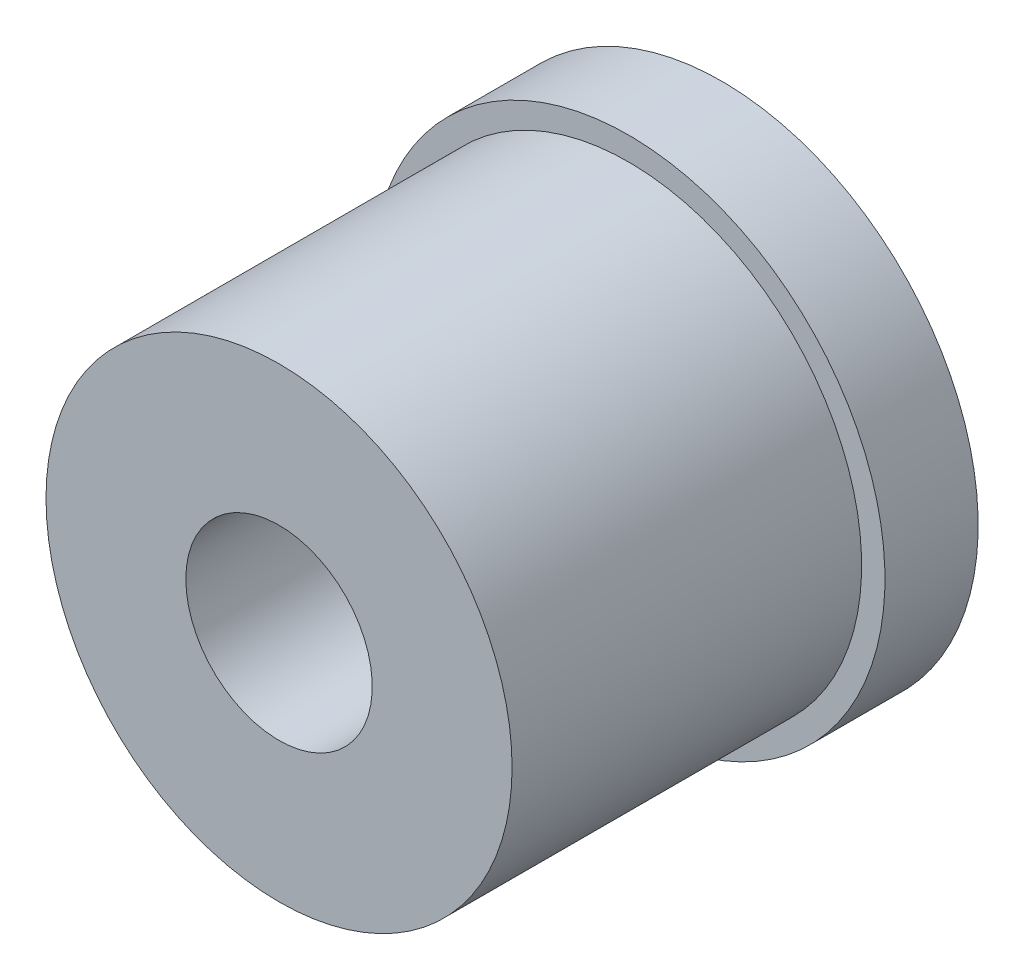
ISO-10303-21;
HEADER;
FILE_DESCRIPTION(('STEP AP214'),'2;1');
FILE_NAME('part.step','',(''),(''),'','','');
FILE_SCHEMA(('AUTOMOTIVE_DESIGN { 1 0 10303 214 1 1 1 1 }'));
ENDSEC;
DATA;
#1=APPLICATION_CONTEXT('core data for automotive mechanical design processes');
#2=APPLICATION_PROTOCOL_DEFINITION('international standard','automotive_design',2000,#1);
#3=PRODUCT_CONTEXT('',#1,'mechanical');
#4=PRODUCT('Part','Part','',(#3));
#5=PRODUCT_RELATED_PRODUCT_CATEGORY('part','',(#4));
#6=PRODUCT_DEFINITION_FORMATION('','',#4);
#7=PRODUCT_DEFINITION_CONTEXT('part definition',#1,'design');
#8=PRODUCT_DEFINITION('design','',#6,#7);
#9=PRODUCT_DEFINITION_SHAPE('','',#8);
#10=(LENGTH_UNIT() NAMED_UNIT(*) SI_UNIT(.MILLI.,.METRE.));
#11=(NAMED_UNIT(*) PLANE_ANGLE_UNIT() SI_UNIT($,.RADIAN.));
#12=(NAMED_UNIT(*) SI_UNIT($,.STERADIAN.) SOLID_ANGLE_UNIT());
#13=UNCERTAINTY_MEASURE_WITH_UNIT(LENGTH_MEASURE(1.E-05),#10,'distance_accuracy_value','');
#14=(GEOMETRIC_REPRESENTATION_CONTEXT(3) GLOBAL_UNCERTAINTY_ASSIGNED_CONTEXT((#13)) GLOBAL_UNIT_ASSIGNED_CONTEXT((#10,
#11,#12)) REPRESENTATION_CONTEXT('',''));
#15=CARTESIAN_POINT('',(0.,0.,0.));
#16=DIRECTION('',(0.,0.,1.));
#17=DIRECTION('',(1.,0.,0.));
#18=AXIS2_PLACEMENT_3D('',#15,#16,#17);
#19=CARTESIAN_POINT('',(0.,0.,3.75));
#20=DIRECTION('',(0.,0.,-1.));
#21=DIRECTION('',(-1.,0.,0.));
#22=AXIS2_PLACEMENT_3D('',#19,#20,#21);
#23=CYLINDRICAL_SURFACE('',#22,2.5);
#24=CARTESIAN_POINT('',(0.,0.,3.75));
#25=DIRECTION('',(0.,0.,1.));
#26=DIRECTION('',(1.,0.,0.));
#27=AXIS2_PLACEMENT_3D('',#24,#25,#26);
#28=CIRCLE('',#27,2.5);
#29=CARTESIAN_POINT('',(2.5,0.,3.75));
#30=VERTEX_POINT('',#29);
#31=EDGE_CURVE('E10',#30,#30,#28,.T.);
#32=ORIENTED_EDGE('',*,*,#31,.F.);
#33=EDGE_LOOP('',(#32));
#34=FACE_BOUND('',#33,.T.);
#35=CARTESIAN_POINT('',(0.,0.,0.));
#36=DIRECTION('',(0.,0.,-1.));
#37=DIRECTION('',(-1.,0.,0.));
#38=AXIS2_PLACEMENT_3D('',#35,#36,#37);
#39=CIRCLE('',#38,2.5);
#40=CARTESIAN_POINT('',(-2.5,0.,0.));
#41=VERTEX_POINT('',#40);
#42=EDGE_CURVE('E31',#41,#41,#39,.T.);
#43=ORIENTED_EDGE('',*,*,#42,.F.);
#44=EDGE_LOOP('',(#43));
#45=FACE_BOUND('',#44,.T.);
#46=ADVANCED_FACE('F25',(#34,#45),#23,.T.);
#47=CARTESIAN_POINT('',(0.,0.,3.75));
#48=DIRECTION('',(0.,0.,1.));
#49=DIRECTION('',(1.,0.,0.));
#50=AXIS2_PLACEMENT_3D('',#47,#48,#49);
#51=PLANE('',#50);
#52=CARTESIAN_POINT('',(0.,0.,3.75));
#53=DIRECTION('',(0.,0.,-1.));
#54=DIRECTION('',(-1.,0.,0.));
#55=AXIS2_PLACEMENT_3D('',#52,#53,#54);
#56=CIRCLE('',#55,1.);
#57=CARTESIAN_POINT('',(-1.,0.,3.75));
#58=VERTEX_POINT('',#57);
#59=EDGE_CURVE('E44',#58,#58,#56,.T.);
#60=ORIENTED_EDGE('',*,*,#59,.T.);
#61=EDGE_LOOP('',(#60));
#62=FACE_BOUND('',#61,.T.);
#63=ORIENTED_EDGE('',*,*,#31,.T.);
#64=EDGE_LOOP('',(#63));
#65=FACE_BOUND('',#64,.T.);
#66=ADVANCED_FACE('F67',(#62,#65),#51,.T.);
#67=CARTESIAN_POINT('',(0.,0.,0.));
#68=DIRECTION('',(0.,0.,-1.));
#69=DIRECTION('',(-1.,0.,0.));
#70=AXIS2_PLACEMENT_3D('',#67,#68,#69);
#71=PLANE('',#70);
#72=CARTESIAN_POINT('',(0.,0.,0.));
#73=DIRECTION('',(0.,0.,-1.));
#74=DIRECTION('',(-1.,0.,0.));
#75=AXIS2_PLACEMENT_3D('',#72,#73,#74);
#76=CIRCLE('',#75,2.75);
#77=CARTESIAN_POINT('',(-2.75,0.,0.));
#78=VERTEX_POINT('',#77);
#79=EDGE_CURVE('E39',#78,#78,#76,.T.);
#80=ORIENTED_EDGE('',*,*,#79,.F.);
#81=EDGE_LOOP('',(#80));
#82=FACE_BOUND('',#81,.T.);
#83=ORIENTED_EDGE('',*,*,#42,.T.);
#84=EDGE_LOOP('',(#83));
#85=FACE_BOUND('',#84,.T.);
#86=ADVANCED_FACE('F62',(#82,#85),#71,.F.);
#87=CARTESIAN_POINT('',(0.,0.,-1.));
#88=DIRECTION('',(0.,0.,1.));
#89=DIRECTION('',(1.,0.,0.));
#90=AXIS2_PLACEMENT_3D('',#87,#88,#89);
#91=CYLINDRICAL_SURFACE('',#90,2.75);
#92=CARTESIAN_POINT('',(0.,0.,-1.));
#93=DIRECTION('',(0.,0.,-1.));
#94=DIRECTION('',(-1.,0.,0.));
#95=AXIS2_PLACEMENT_3D('',#92,#93,#94);
#96=CIRCLE('',#95,2.75);
#97=CARTESIAN_POINT('',(-2.75,0.,-1.));
#98=VERTEX_POINT('',#97);
#99=EDGE_CURVE('E35',#98,#98,#96,.T.);
#100=ORIENTED_EDGE('',*,*,#99,.F.);
#101=EDGE_LOOP('',(#100));
#102=FACE_BOUND('',#101,.T.);
#103=ORIENTED_EDGE('',*,*,#79,.T.);
#104=EDGE_LOOP('',(#103));
#105=FACE_BOUND('',#104,.T.);
#106=ADVANCED_FACE('F56',(#102,#105),#91,.T.);
#107=CARTESIAN_POINT('',(0.,0.,-1.));
#108=DIRECTION('',(0.,0.,-1.));
#109=DIRECTION('',(-1.,0.,0.));
#110=AXIS2_PLACEMENT_3D('',#107,#108,#109);
#111=PLANE('',#110);
#112=CARTESIAN_POINT('',(0.,0.,-1.));
#113=DIRECTION('',(0.,0.,-1.));
#114=DIRECTION('',(-1.,0.,0.));
#115=AXIS2_PLACEMENT_3D('',#112,#113,#114);
#116=CIRCLE('',#115,1.);
#117=CARTESIAN_POINT('',(-1.,0.,-1.));
#118=VERTEX_POINT('',#117);
#119=EDGE_CURVE('E47',#118,#118,#116,.T.);
#120=ORIENTED_EDGE('',*,*,#119,.F.);
#121=EDGE_LOOP('',(#120));
#122=FACE_BOUND('',#121,.T.);
#123=ORIENTED_EDGE('',*,*,#99,.T.);
#124=EDGE_LOOP('',(#123));
#125=FACE_BOUND('',#124,.T.);
#126=ADVANCED_FACE('F53',(#122,#125),#111,.T.);
#127=CARTESIAN_POINT('',(0.,0.,3.75));
#128=DIRECTION('',(0.,0.,-1.));
#129=DIRECTION('',(-1.,0.,0.));
#130=AXIS2_PLACEMENT_3D('',#127,#128,#129);
#131=CYLINDRICAL_SURFACE('',#130,1.);
#132=ORIENTED_EDGE('',*,*,#59,.F.);
#133=EDGE_LOOP('',(#132));
#134=FACE_BOUND('',#133,.T.);
#135=ORIENTED_EDGE('',*,*,#119,.T.);
#136=EDGE_LOOP('',(#135));
#137=FACE_BOUND('',#136,.T.);
#138=ADVANCED_FACE('F51',(#134,#137),#131,.F.);
#139=CLOSED_SHELL('',(#46,#66,#86,#106,#126,#138));
#140=MANIFOLD_SOLID_BREP('B2',#139);
#141=ADVANCED_BREP_SHAPE_REPRESENTATION('',(#18,#140),#14);
#142=SHAPE_DEFINITION_REPRESENTATION(#9,#141);
ENDSEC;
END-ISO-10303-21;
